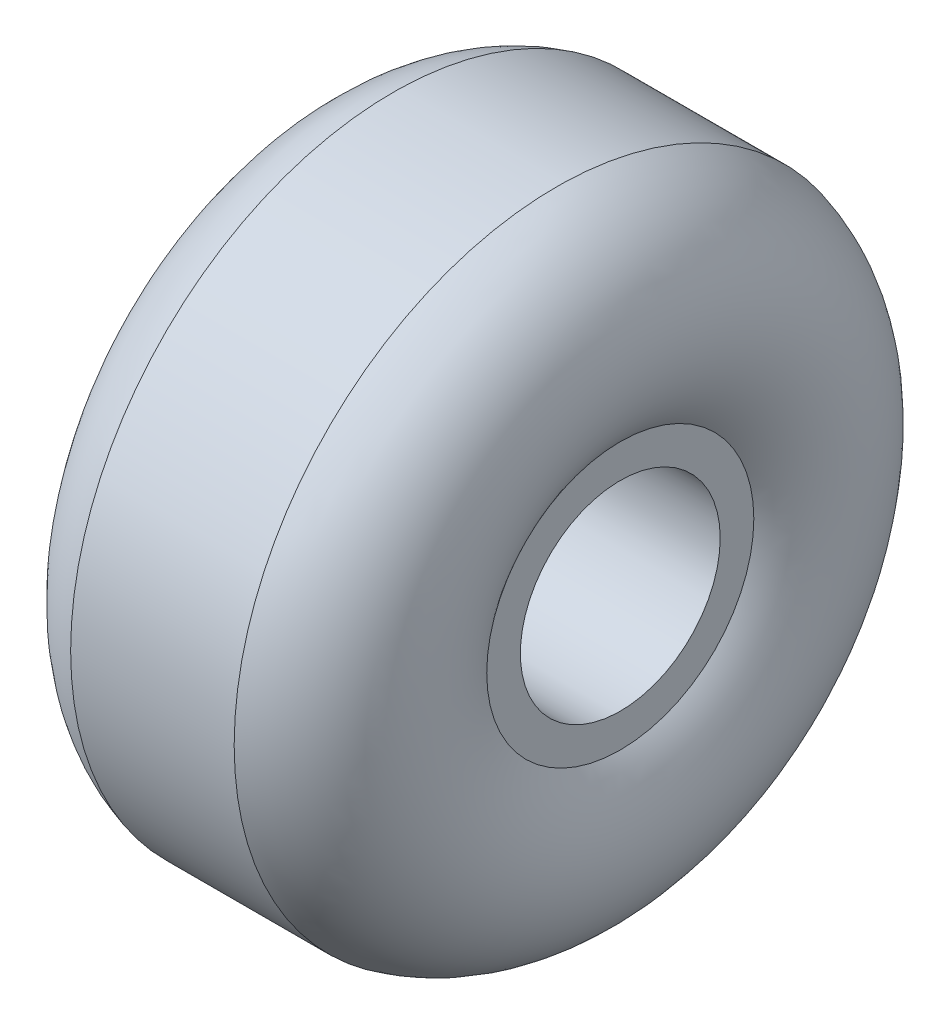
ISO-10303-21;
HEADER;
FILE_DESCRIPTION(('STEP AP214'),'2;1');
FILE_NAME('part.step','',(''),(''),'','','');
FILE_SCHEMA(('AUTOMOTIVE_DESIGN { 1 0 10303 214 1 1 1 1 }'));
ENDSEC;
DATA;
#1=APPLICATION_CONTEXT('core data for automotive mechanical design processes');
#2=APPLICATION_PROTOCOL_DEFINITION('international standard','automotive_design',2000,#1);
#3=PRODUCT_CONTEXT('',#1,'mechanical');
#4=PRODUCT('Part','Part','',(#3));
#5=PRODUCT_RELATED_PRODUCT_CATEGORY('part','',(#4));
#6=PRODUCT_DEFINITION_FORMATION('','',#4);
#7=PRODUCT_DEFINITION_CONTEXT('part definition',#1,'design');
#8=PRODUCT_DEFINITION('design','',#6,#7);
#9=PRODUCT_DEFINITION_SHAPE('','',#8);
#10=(LENGTH_UNIT() NAMED_UNIT(*) SI_UNIT(.MILLI.,.METRE.));
#11=(NAMED_UNIT(*) PLANE_ANGLE_UNIT() SI_UNIT($,.RADIAN.));
#12=(NAMED_UNIT(*) SI_UNIT($,.STERADIAN.) SOLID_ANGLE_UNIT());
#13=UNCERTAINTY_MEASURE_WITH_UNIT(LENGTH_MEASURE(1.E-05),#10,'distance_accuracy_value','');
#14=(GEOMETRIC_REPRESENTATION_CONTEXT(3) GLOBAL_UNCERTAINTY_ASSIGNED_CONTEXT((#13)) GLOBAL_UNIT_ASSIGNED_CONTEXT((#10,
#11,#12)) REPRESENTATION_CONTEXT('',''));
#15=CARTESIAN_POINT('',(0.,0.,0.));
#16=DIRECTION('',(0.,0.,1.));
#17=DIRECTION('',(1.,0.,0.));
#18=AXIS2_PLACEMENT_3D('',#15,#16,#17);
#19=CARTESIAN_POINT('',(16.,0.,0.));
#20=DIRECTION('',(-1.,0.,0.));
#21=DIRECTION('',(0.,0.,1.));
#22=AXIS2_PLACEMENT_3D('',#19,#20,#21);
#23=PLANE('',#22);
#24=CARTESIAN_POINT('',(16.,0.,0.));
#25=DIRECTION('',(1.,0.,0.));
#26=DIRECTION('',(0.,0.,-1.));
#27=AXIS2_PLACEMENT_3D('',#24,#25,#26);
#28=CIRCLE('',#27,11.);
#29=CARTESIAN_POINT('',(16.,0.,-11.));
#30=VERTEX_POINT('',#29);
#31=EDGE_CURVE('E50',#30,#30,#28,.T.);
#32=ORIENTED_EDGE('',*,*,#31,.F.);
#33=EDGE_LOOP('',(#32));
#34=FACE_BOUND('',#33,.T.);
#35=CARTESIAN_POINT('',(16.,0.,0.));
#36=DIRECTION('',(-1.,0.,0.));
#37=DIRECTION('',(0.,0.,1.));
#38=AXIS2_PLACEMENT_3D('',#35,#36,#37);
#39=CIRCLE('',#38,14.7);
#40=CARTESIAN_POINT('',(16.,0.,14.7));
#41=VERTEX_POINT('',#40);
#42=EDGE_CURVE('E47',#41,#41,#39,.T.);
#43=ORIENTED_EDGE('',*,*,#42,.F.);
#44=EDGE_LOOP('',(#43));
#45=FACE_BOUND('',#44,.T.);
#46=ADVANCED_FACE('F31',(#34,#45),#23,.F.);
#47=CARTESIAN_POINT('',(-16.,0.,0.));
#48=DIRECTION('',(1.,0.,0.));
#49=DIRECTION('',(0.,0.,-1.));
#50=AXIS2_PLACEMENT_3D('',#47,#48,#49);
#51=PLANE('',#50);
#52=CARTESIAN_POINT('',(-16.,0.,0.));
#53=DIRECTION('',(1.,0.,0.));
#54=DIRECTION('',(0.,0.,-1.));
#55=AXIS2_PLACEMENT_3D('',#52,#53,#54);
#56=CIRCLE('',#55,11.);
#57=CARTESIAN_POINT('',(-16.,0.,-11.));
#58=VERTEX_POINT('',#57);
#59=EDGE_CURVE('E34',#58,#58,#56,.T.);
#60=ORIENTED_EDGE('',*,*,#59,.T.);
#61=EDGE_LOOP('',(#60));
#62=FACE_BOUND('',#61,.T.);
#63=CARTESIAN_POINT('',(-16.,0.,0.));
#64=DIRECTION('',(-1.,0.,0.));
#65=DIRECTION('',(0.,0.,1.));
#66=AXIS2_PLACEMENT_3D('',#63,#64,#65);
#67=CIRCLE('',#66,14.7);
#68=CARTESIAN_POINT('',(-16.,0.,14.7));
#69=VERTEX_POINT('',#68);
#70=EDGE_CURVE('E10',#69,#69,#67,.T.);
#71=ORIENTED_EDGE('',*,*,#70,.T.);
#72=EDGE_LOOP('',(#71));
#73=FACE_BOUND('',#72,.T.);
#74=ADVANCED_FACE('F57',(#62,#73),#51,.F.);
#75=CARTESIAN_POINT('',(-5.89343806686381,0.,0.));
#76=DIRECTION('',(-1.,0.,0.));
#77=DIRECTION('',(0.,0.,1.));
#78=AXIS2_PLACEMENT_3D('',#75,#76,#77);
#79=TOROIDAL_SURFACE('',#78,22.8766378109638,13.);
#80=ORIENTED_EDGE('',*,*,#70,.F.);
#81=EDGE_LOOP('',(#80));
#82=FACE_BOUND('',#81,.T.);
#83=CARTESIAN_POINT('',(-9.00000000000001,0.,0.));
#84=DIRECTION('',(-1.,0.,0.));
#85=DIRECTION('',(0.,0.,1.));
#86=AXIS2_PLACEMENT_3D('',#83,#84,#85);
#87=CIRCLE('',#86,35.5);
#88=CARTESIAN_POINT('',(-9.00000000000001,0.,35.5));
#89=VERTEX_POINT('',#88);
#90=EDGE_CURVE('E38',#89,#89,#87,.T.);
#91=ORIENTED_EDGE('',*,*,#90,.T.);
#92=EDGE_LOOP('',(#91));
#93=FACE_BOUND('',#92,.T.);
#94=ADVANCED_FACE('F74',(#82,#93),#79,.T.);
#95=CARTESIAN_POINT('',(-16.,0.,0.));
#96=DIRECTION('',(-1.,0.,0.));
#97=DIRECTION('',(0.,0.,1.));
#98=AXIS2_PLACEMENT_3D('',#95,#96,#97);
#99=CYLINDRICAL_SURFACE('',#98,35.5);
#100=ORIENTED_EDGE('',*,*,#90,.F.);
#101=EDGE_LOOP('',(#100));
#102=FACE_BOUND('',#101,.T.);
#103=CARTESIAN_POINT('',(9.,0.,0.));
#104=DIRECTION('',(-1.,0.,0.));
#105=DIRECTION('',(0.,0.,1.));
#106=AXIS2_PLACEMENT_3D('',#103,#104,#105);
#107=CIRCLE('',#106,35.5);
#108=CARTESIAN_POINT('',(9.,0.,35.5));
#109=VERTEX_POINT('',#108);
#110=EDGE_CURVE('E42',#109,#109,#107,.T.);
#111=ORIENTED_EDGE('',*,*,#110,.T.);
#112=EDGE_LOOP('',(#111));
#113=FACE_BOUND('',#112,.T.);
#114=ADVANCED_FACE('F66',(#102,#113),#99,.T.);
#115=CARTESIAN_POINT('',(5.89343806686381,0.,0.));
#116=DIRECTION('',(-1.,0.,0.));
#117=DIRECTION('',(0.,0.,1.));
#118=AXIS2_PLACEMENT_3D('',#115,#116,#117);
#119=TOROIDAL_SURFACE('',#118,22.8766378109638,13.);
#120=ORIENTED_EDGE('',*,*,#110,.F.);
#121=EDGE_LOOP('',(#120));
#122=FACE_BOUND('',#121,.T.);
#123=ORIENTED_EDGE('',*,*,#42,.T.);
#124=EDGE_LOOP('',(#123));
#125=FACE_BOUND('',#124,.T.);
#126=ADVANCED_FACE('F61',(#122,#125),#119,.T.);
#127=CARTESIAN_POINT('',(-18.8934380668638,0.,0.));
#128=DIRECTION('',(1.,0.,0.));
#129=DIRECTION('',(0.,0.,-1.));
#130=AXIS2_PLACEMENT_3D('',#127,#128,#129);
#131=CYLINDRICAL_SURFACE('',#130,11.);
#132=ORIENTED_EDGE('',*,*,#31,.T.);
#133=EDGE_LOOP('',(#132));
#134=FACE_BOUND('',#133,.T.);
#135=ORIENTED_EDGE('',*,*,#59,.F.);
#136=EDGE_LOOP('',(#135));
#137=FACE_BOUND('',#136,.T.);
#138=ADVANCED_FACE('F59',(#134,#137),#131,.F.);
#139=CLOSED_SHELL('',(#46,#74,#94,#114,#126,#138));
#140=MANIFOLD_SOLID_BREP('B2',#139);
#141=ADVANCED_BREP_SHAPE_REPRESENTATION('',(#18,#140),#14);
#142=SHAPE_DEFINITION_REPRESENTATION(#9,#141);
ENDSEC;
END-ISO-10303-21;
